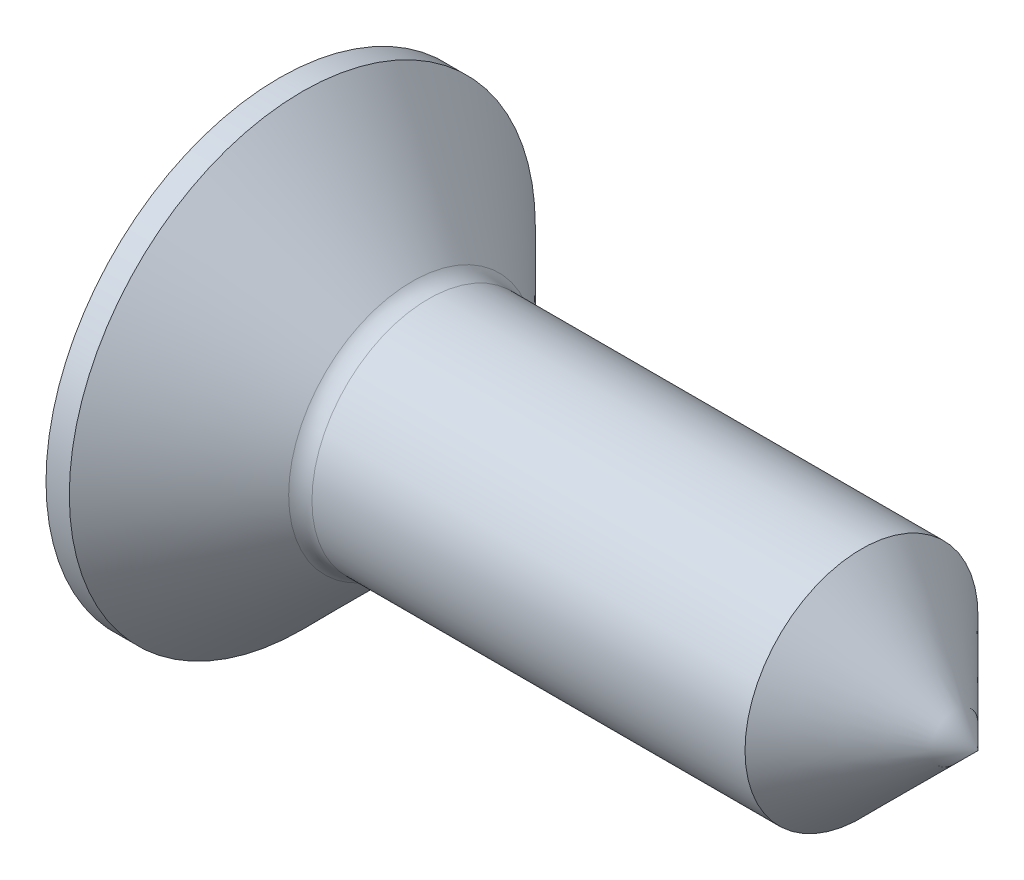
ISO-10303-21;
HEADER;
FILE_DESCRIPTION(('STEP AP214'),'2;1');
FILE_NAME('part.step','',(''),(''),'','','');
FILE_SCHEMA(('AUTOMOTIVE_DESIGN { 1 0 10303 214 1 1 1 1 }'));
ENDSEC;
DATA;
#1=APPLICATION_CONTEXT('core data for automotive mechanical design processes');
#2=APPLICATION_PROTOCOL_DEFINITION('international standard','automotive_design',2000,#1);
#3=PRODUCT_CONTEXT('',#1,'mechanical');
#4=PRODUCT('Part','Part','',(#3));
#5=PRODUCT_RELATED_PRODUCT_CATEGORY('part','',(#4));
#6=PRODUCT_DEFINITION_FORMATION('','',#4);
#7=PRODUCT_DEFINITION_CONTEXT('part definition',#1,'design');
#8=PRODUCT_DEFINITION('design','',#6,#7);
#9=PRODUCT_DEFINITION_SHAPE('','',#8);
#10=(LENGTH_UNIT() NAMED_UNIT(*) SI_UNIT(.MILLI.,.METRE.));
#11=(NAMED_UNIT(*) PLANE_ANGLE_UNIT() SI_UNIT($,.RADIAN.));
#12=(NAMED_UNIT(*) SI_UNIT($,.STERADIAN.) SOLID_ANGLE_UNIT());
#13=UNCERTAINTY_MEASURE_WITH_UNIT(LENGTH_MEASURE(1.E-05),#10,'distance_accuracy_value','');
#14=(GEOMETRIC_REPRESENTATION_CONTEXT(3) GLOBAL_UNCERTAINTY_ASSIGNED_CONTEXT((#13)) GLOBAL_UNIT_ASSIGNED_CONTEXT((#10,
#11,#12)) REPRESENTATION_CONTEXT('',''));
#15=CARTESIAN_POINT('',(0.,0.,0.));
#16=DIRECTION('',(0.,0.,1.));
#17=DIRECTION('',(1.,0.,0.));
#18=AXIS2_PLACEMENT_3D('',#15,#16,#17);
#19=CARTESIAN_POINT('',(3.63333333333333,0.,0.));
#20=DIRECTION('',(-1.,0.,0.));
#21=DIRECTION('',(0.,0.,-1.));
#22=AXIS2_PLACEMENT_3D('',#19,#20,#21);
#23=SPHERICAL_SURFACE('',#22,3.63333333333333);
#24=CARTESIAN_POINT('',(0.6,0.,0.));
#25=DIRECTION('',(-1.,0.,0.));
#26=DIRECTION('',(0.,0.,1.));
#27=AXIS2_PLACEMENT_3D('',#24,#25,#26);
#28=CIRCLE('',#27,2.);
#29=CARTESIAN_POINT('',(0.6,0.,2.));
#30=VERTEX_POINT('',#29);
#31=EDGE_CURVE('E216',#30,#30,#28,.T.);
#32=ORIENTED_EDGE('',*,*,#31,.T.);
#33=EDGE_LOOP('',(#32));
#34=FACE_BOUND('',#33,.T.);
#35=CARTESIAN_POINT('',(3.55368534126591,-0.389390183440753,0.));
#36=DIRECTION('',(-0.200396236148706,-0.979714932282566,0.));
#37=DIRECTION('',(0.979714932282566,-0.200396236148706,0.));
#38=AXIS2_PLACEMENT_3D('',#35,#36,#37);
#39=CIRCLE('',#38,3.61152912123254);
#40=CARTESIAN_POINT('',(0.209209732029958,0.294707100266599,1.1788284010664));
#41=VERTEX_POINT('',#40);
#42=CARTESIAN_POINT('',(0.0303348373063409,0.331295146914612,0.331295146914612));
#43=VERTEX_POINT('',#42);
#44=EDGE_CURVE('E12',#41,#43,#39,.T.);
#45=ORIENTED_EDGE('',*,*,#44,.F.);
#46=CARTESIAN_POINT('',(2.83803630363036,0.,-0.972029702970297));
#47=DIRECTION('',(-0.633237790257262,0.,-0.773957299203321));
#48=DIRECTION('',(-0.773957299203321,0.,0.633237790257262));
#49=AXIS2_PLACEMENT_3D('',#46,#47,#48);
#50=CIRCLE('',#49,3.40936533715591);
#51=CARTESIAN_POINT('',(0.209209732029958,-0.2947071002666,1.1788284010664));
#52=VERTEX_POINT('',#51);
#53=EDGE_CURVE('E120',#52,#41,#50,.T.);
#54=ORIENTED_EDGE('',*,*,#53,.F.);
#55=CARTESIAN_POINT('',(3.55368534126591,0.389390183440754,0.));
#56=DIRECTION('',(-0.200396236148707,0.979714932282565,0.));
#57=DIRECTION('',(-0.979714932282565,-0.200396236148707,0.));
#58=AXIS2_PLACEMENT_3D('',#55,#56,#57);
#59=CIRCLE('',#58,3.61152912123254);
#60=CARTESIAN_POINT('',(0.0303348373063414,-0.331295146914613,0.331295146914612));
#61=VERTEX_POINT('',#60);
#62=EDGE_CURVE('E128',#61,#52,#59,.T.);
#63=ORIENTED_EDGE('',*,*,#62,.F.);
#64=CARTESIAN_POINT('',(3.55368534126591,0.,-0.389390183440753));
#65=DIRECTION('',(-0.200396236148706,0.,-0.979714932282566));
#66=DIRECTION('',(-0.979714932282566,0.,0.200396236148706));
#67=AXIS2_PLACEMENT_3D('',#64,#65,#66);
#68=CIRCLE('',#67,3.61152912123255);
#69=CARTESIAN_POINT('',(0.209209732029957,-1.1788284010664,0.294707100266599));
#70=VERTEX_POINT('',#69);
#71=EDGE_CURVE('E136',#70,#61,#68,.T.);
#72=ORIENTED_EDGE('',*,*,#71,.F.);
#73=CARTESIAN_POINT('',(2.83803630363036,0.972029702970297,0.));
#74=DIRECTION('',(-0.633237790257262,0.773957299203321,0.));
#75=DIRECTION('',(-0.773957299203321,-0.633237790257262,0.));
#76=AXIS2_PLACEMENT_3D('',#73,#74,#75);
#77=CIRCLE('',#76,3.40936533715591);
#78=CARTESIAN_POINT('',(0.209209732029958,-1.1788284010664,-0.2947071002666));
#79=VERTEX_POINT('',#78);
#80=EDGE_CURVE('E144',#79,#70,#77,.T.);
#81=ORIENTED_EDGE('',*,*,#80,.F.);
#82=CARTESIAN_POINT('',(3.55368534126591,0.,0.389390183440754));
#83=DIRECTION('',(-0.200396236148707,0.,0.979714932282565));
#84=DIRECTION('',(0.979714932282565,0.,0.200396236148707));
#85=AXIS2_PLACEMENT_3D('',#82,#83,#84);
#86=CIRCLE('',#85,3.61152912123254);
#87=CARTESIAN_POINT('',(0.0303348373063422,-0.331295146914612,-0.331295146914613));
#88=VERTEX_POINT('',#87);
#89=EDGE_CURVE('E152',#88,#79,#86,.T.);
#90=ORIENTED_EDGE('',*,*,#89,.F.);
#91=CARTESIAN_POINT('',(3.55368534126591,0.389390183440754,0.));
#92=DIRECTION('',(-0.200396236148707,0.979714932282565,0.));
#93=DIRECTION('',(-0.979714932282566,-0.200396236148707,0.));
#94=AXIS2_PLACEMENT_3D('',#91,#92,#93);
#95=CIRCLE('',#94,3.61152912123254);
#96=CARTESIAN_POINT('',(0.209209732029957,-0.2947071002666,-1.1788284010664));
#97=VERTEX_POINT('',#96);
#98=EDGE_CURVE('E160',#97,#88,#95,.T.);
#99=ORIENTED_EDGE('',*,*,#98,.F.);
#100=CARTESIAN_POINT('',(2.83803630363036,0.,0.972029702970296));
#101=DIRECTION('',(-0.633237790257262,0.,0.773957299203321));
#102=DIRECTION('',(0.773957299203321,0.,0.633237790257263));
#103=AXIS2_PLACEMENT_3D('',#100,#101,#102);
#104=CIRCLE('',#103,3.40936533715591);
#105=CARTESIAN_POINT('',(0.209209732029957,0.294707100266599,-1.1788284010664));
#106=VERTEX_POINT('',#105);
#107=EDGE_CURVE('E168',#106,#97,#104,.T.);
#108=ORIENTED_EDGE('',*,*,#107,.F.);
#109=CARTESIAN_POINT('',(3.55368534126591,-0.389390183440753,0.));
#110=DIRECTION('',(-0.200396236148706,-0.979714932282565,0.));
#111=DIRECTION('',(0.979714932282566,-0.200396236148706,0.));
#112=AXIS2_PLACEMENT_3D('',#109,#110,#111);
#113=CIRCLE('',#112,3.61152912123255);
#114=CARTESIAN_POINT('',(0.0303348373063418,0.331295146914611,-0.331295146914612));
#115=VERTEX_POINT('',#114);
#116=EDGE_CURVE('E176',#115,#106,#113,.T.);
#117=ORIENTED_EDGE('',*,*,#116,.F.);
#118=CARTESIAN_POINT('',(3.55368534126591,0.,0.389390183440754));
#119=DIRECTION('',(-0.200396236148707,0.,0.979714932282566));
#120=DIRECTION('',(0.979714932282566,0.,0.200396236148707));
#121=AXIS2_PLACEMENT_3D('',#118,#119,#120);
#122=CIRCLE('',#121,3.61152912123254);
#123=CARTESIAN_POINT('',(0.209209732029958,1.1788284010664,-0.2947071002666));
#124=VERTEX_POINT('',#123);
#125=EDGE_CURVE('E183',#124,#115,#122,.T.);
#126=ORIENTED_EDGE('',*,*,#125,.F.);
#127=CARTESIAN_POINT('',(2.83803630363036,-0.972029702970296,0.));
#128=DIRECTION('',(-0.633237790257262,-0.773957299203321,0.));
#129=DIRECTION('',(0.773957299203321,-0.633237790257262,0.));
#130=AXIS2_PLACEMENT_3D('',#127,#128,#129);
#131=CIRCLE('',#130,3.40936533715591);
#132=CARTESIAN_POINT('',(0.209209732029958,1.1788284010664,0.2947071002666));
#133=VERTEX_POINT('',#132);
#134=EDGE_CURVE('E187',#133,#124,#131,.T.);
#135=ORIENTED_EDGE('',*,*,#134,.F.);
#136=CARTESIAN_POINT('',(3.55368534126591,0.,-0.389390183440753));
#137=DIRECTION('',(-0.200396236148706,0.,-0.979714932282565));
#138=DIRECTION('',(-0.979714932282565,0.,0.200396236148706));
#139=AXIS2_PLACEMENT_3D('',#136,#137,#138);
#140=CIRCLE('',#139,3.61152912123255);
#141=EDGE_CURVE('E57',#43,#133,#140,.T.);
#142=ORIENTED_EDGE('',*,*,#141,.F.);
#143=EDGE_LOOP('',(#45,#54,#63,#72,#81,#90,#99,#108,#117,#126,#135,#142));
#144=FACE_BOUND('',#143,.T.);
#145=ADVANCED_FACE('F49',(#34,#144),#23,.T.);
#146=CARTESIAN_POINT('',(-7.24054878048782,0.,0.));
#147=DIRECTION('',(-1.,0.,0.));
#148=DIRECTION('',(0.,0.,1.));
#149=AXIS2_PLACEMENT_3D('',#146,#147,#148);
#150=CYLINDRICAL_SURFACE('',#149,1.);
#151=CARTESIAN_POINT('',(1.88284271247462,0.,0.));
#152=DIRECTION('',(-1.,0.,0.));
#153=DIRECTION('',(0.,0.,1.));
#154=AXIS2_PLACEMENT_3D('',#151,#152,#153);
#155=CIRCLE('',#154,1.);
#156=CARTESIAN_POINT('',(1.88284271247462,0.,1.));
#157=VERTEX_POINT('',#156);
#158=EDGE_CURVE('E225',#157,#157,#155,.F.);
#159=ORIENTED_EDGE('',*,*,#158,.T.);
#160=EDGE_LOOP('',(#159));
#161=FACE_BOUND('',#160,.T.);
#162=CARTESIAN_POINT('',(5.6,0.,0.));
#163=DIRECTION('',(-1.,0.,0.));
#164=DIRECTION('',(0.,0.,1.));
#165=AXIS2_PLACEMENT_3D('',#162,#163,#164);
#166=CIRCLE('',#165,1.);
#167=CARTESIAN_POINT('',(5.6,0.,1.));
#168=VERTEX_POINT('',#167);
#169=EDGE_CURVE('E112',#168,#168,#166,.F.);
#170=ORIENTED_EDGE('',*,*,#169,.F.);
#171=EDGE_LOOP('',(#170));
#172=FACE_BOUND('',#171,.T.);
#173=ADVANCED_FACE('F243',(#161,#172),#150,.T.);
#174=CARTESIAN_POINT('',(1.8,0.,0.));
#175=DIRECTION('',(-1.,0.,0.));
#176=DIRECTION('',(0.,0.,1.));
#177=AXIS2_PLACEMENT_3D('',#174,#175,#176);
#178=CONICAL_SURFACE('',#177,1.,0.785398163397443);
#179=CARTESIAN_POINT('',(1.74142135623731,0.,0.));
#180=DIRECTION('',(-1.,0.,0.));
#181=DIRECTION('',(0.,0.,1.));
#182=AXIS2_PLACEMENT_3D('',#179,#180,#181);
#183=CIRCLE('',#182,1.05857864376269);
#184=CARTESIAN_POINT('',(1.74142135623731,0.,1.05857864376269));
#185=VERTEX_POINT('',#184);
#186=EDGE_CURVE('E222',#185,#185,#183,.T.);
#187=ORIENTED_EDGE('',*,*,#186,.T.);
#188=EDGE_LOOP('',(#187));
#189=FACE_BOUND('',#188,.T.);
#190=CARTESIAN_POINT('',(0.79999999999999,0.,0.));
#191=DIRECTION('',(-1.,0.,0.));
#192=DIRECTION('',(0.,0.,1.));
#193=AXIS2_PLACEMENT_3D('',#190,#191,#192);
#194=CIRCLE('',#193,2.);
#195=CARTESIAN_POINT('',(0.79999999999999,0.,2.));
#196=VERTEX_POINT('',#195);
#197=EDGE_CURVE('E219',#196,#196,#194,.T.);
#198=ORIENTED_EDGE('',*,*,#197,.F.);
#199=EDGE_LOOP('',(#198));
#200=FACE_BOUND('',#199,.T.);
#201=ADVANCED_FACE('F245',(#189,#200),#178,.T.);
#202=CARTESIAN_POINT('',(-7.24054878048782,0.,0.));
#203=DIRECTION('',(-1.,0.,0.));
#204=DIRECTION('',(0.,0.,1.));
#205=AXIS2_PLACEMENT_3D('',#202,#203,#204);
#206=CYLINDRICAL_SURFACE('',#205,2.);
#207=ORIENTED_EDGE('',*,*,#31,.F.);
#208=EDGE_LOOP('',(#207));
#209=FACE_BOUND('',#208,.T.);
#210=ORIENTED_EDGE('',*,*,#197,.T.);
#211=EDGE_LOOP('',(#210));
#212=FACE_BOUND('',#211,.T.);
#213=ADVANCED_FACE('F252',(#209,#212),#206,.T.);
#214=CARTESIAN_POINT('',(1.88284271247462,0.,0.));
#215=DIRECTION('',(-1.,0.,0.));
#216=DIRECTION('',(0.,0.,1.));
#217=AXIS2_PLACEMENT_3D('',#214,#215,#216);
#218=TOROIDAL_SURFACE('',#217,1.2,0.2);
#219=ORIENTED_EDGE('',*,*,#158,.F.);
#220=EDGE_LOOP('',(#219));
#221=FACE_BOUND('',#220,.T.);
#222=ORIENTED_EDGE('',*,*,#186,.F.);
#223=EDGE_LOOP('',(#222));
#224=FACE_BOUND('',#223,.T.);
#225=ADVANCED_FACE('F51',(#221,#224),#218,.F.);
#226=CARTESIAN_POINT('',(-13.3999999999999,0.,0.));
#227=DIRECTION('',(-1.,0.,0.));
#228=DIRECTION('',(0.,0.,1.));
#229=AXIS2_PLACEMENT_3D('',#226,#227,#228);
#230=CONICAL_SURFACE('',#229,20.,0.78539816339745);
#231=CARTESIAN_POINT('',(6.6,0.,0.));
#232=VERTEX_POINT('',#231);
#233=VERTEX_LOOP('',#232);
#234=FACE_BOUND('',#233,.T.);
#235=ORIENTED_EDGE('',*,*,#169,.T.);
#236=EDGE_LOOP('',(#235));
#237=FACE_BOUND('',#236,.T.);
#238=ADVANCED_FACE('F241',(#234,#237),#230,.T.);
#239=CARTESIAN_POINT('',(0.,0.337499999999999,1.35));
#240=DIRECTION('',(-0.200396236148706,-0.979714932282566,0.));
#241=DIRECTION('',(0.979714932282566,-0.200396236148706,0.));
#242=AXIS2_PLACEMENT_3D('',#239,#240,#241);
#243=PLANE('',#242);
#244=ORIENTED_EDGE('',*,*,#44,.T.);
#245=DIRECTION('',(0.96061626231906,-0.196489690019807,-0.196489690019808));
#246=VECTOR('',#245,1.);
#247=CARTESIAN_POINT('',(0.,0.3375,0.3375));
#248=LINE('',#247,#246);
#249=CARTESIAN_POINT('',(1.65,0.,0.));
#250=VERTEX_POINT('',#249);
#251=EDGE_CURVE('E105',#43,#250,#248,.T.);
#252=ORIENTED_EDGE('',*,*,#251,.T.);
#253=DIRECTION('',(0.764437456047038,-0.156362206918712,-0.625448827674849));
#254=VECTOR('',#253,1.);
#255=CARTESIAN_POINT('',(0.,0.337499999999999,1.35));
#256=LINE('',#255,#254);
#257=EDGE_CURVE('E108',#41,#250,#256,.T.);
#258=ORIENTED_EDGE('',*,*,#257,.F.);
#259=EDGE_LOOP('',(#244,#252,#258));
#260=FACE_BOUND('',#259,.T.);
#261=ADVANCED_FACE('F107',(#260),#243,.T.);
#262=CARTESIAN_POINT('',(0.,0.3375,0.3375));
#263=DIRECTION('',(-0.200396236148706,0.,-0.979714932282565));
#264=DIRECTION('',(-0.979714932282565,0.,0.200396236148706));
#265=AXIS2_PLACEMENT_3D('',#262,#263,#264);
#266=PLANE('',#265);
#267=ORIENTED_EDGE('',*,*,#141,.T.);
#268=DIRECTION('',(0.764437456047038,-0.625448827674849,-0.156362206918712));
#269=VECTOR('',#268,1.);
#270=CARTESIAN_POINT('',(0.,1.35,0.3375));
#271=LINE('',#270,#269);
#272=EDGE_CURVE('E64',#133,#250,#271,.T.);
#273=ORIENTED_EDGE('',*,*,#272,.T.);
#274=ORIENTED_EDGE('',*,*,#251,.F.);
#275=EDGE_LOOP('',(#267,#273,#274));
#276=FACE_BOUND('',#275,.T.);
#277=ADVANCED_FACE('F189',(#276),#266,.T.);
#278=CARTESIAN_POINT('',(0.,-0.3375,1.35));
#279=DIRECTION('',(-0.633237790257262,0.,-0.773957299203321));
#280=DIRECTION('',(-0.773957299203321,0.,0.633237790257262));
#281=AXIS2_PLACEMENT_3D('',#278,#279,#280);
#282=PLANE('',#281);
#283=ORIENTED_EDGE('',*,*,#53,.T.);
#284=ORIENTED_EDGE('',*,*,#257,.T.);
#285=DIRECTION('',(0.764437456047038,0.156362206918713,-0.625448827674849));
#286=VECTOR('',#285,1.);
#287=CARTESIAN_POINT('',(0.,-0.337500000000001,1.35));
#288=LINE('',#287,#286);
#289=EDGE_CURVE('E118',#52,#250,#288,.T.);
#290=ORIENTED_EDGE('',*,*,#289,.F.);
#291=EDGE_LOOP('',(#283,#284,#290));
#292=FACE_BOUND('',#291,.T.);
#293=ADVANCED_FACE('F117',(#292),#282,.T.);
#294=CARTESIAN_POINT('',(0.,-0.337500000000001,0.3375));
#295=DIRECTION('',(-0.200396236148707,0.979714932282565,0.));
#296=DIRECTION('',(-0.979714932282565,-0.200396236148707,0.));
#297=AXIS2_PLACEMENT_3D('',#294,#295,#296);
#298=PLANE('',#297);
#299=ORIENTED_EDGE('',*,*,#62,.T.);
#300=ORIENTED_EDGE('',*,*,#289,.T.);
#301=DIRECTION('',(0.960616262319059,0.196489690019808,-0.196489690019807));
#302=VECTOR('',#301,1.);
#303=CARTESIAN_POINT('',(0.,-0.337500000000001,0.3375));
#304=LINE('',#303,#302);
#305=EDGE_CURVE('E126',#61,#250,#304,.T.);
#306=ORIENTED_EDGE('',*,*,#305,.F.);
#307=EDGE_LOOP('',(#299,#300,#306));
#308=FACE_BOUND('',#307,.T.);
#309=ADVANCED_FACE('F125',(#308),#298,.T.);
#310=CARTESIAN_POINT('',(0.,-1.35,0.3375));
#311=DIRECTION('',(-0.200396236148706,0.,-0.979714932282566));
#312=DIRECTION('',(-0.979714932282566,0.,0.200396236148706));
#313=AXIS2_PLACEMENT_3D('',#310,#311,#312);
#314=PLANE('',#313);
#315=ORIENTED_EDGE('',*,*,#71,.T.);
#316=ORIENTED_EDGE('',*,*,#305,.T.);
#317=DIRECTION('',(0.764437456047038,0.625448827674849,-0.156362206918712));
#318=VECTOR('',#317,1.);
#319=CARTESIAN_POINT('',(0.,-1.35,0.3375));
#320=LINE('',#319,#318);
#321=EDGE_CURVE('E134',#70,#250,#320,.T.);
#322=ORIENTED_EDGE('',*,*,#321,.F.);
#323=EDGE_LOOP('',(#315,#316,#322));
#324=FACE_BOUND('',#323,.T.);
#325=ADVANCED_FACE('F133',(#324),#314,.T.);
#326=CARTESIAN_POINT('',(0.,-1.35,-0.337500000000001));
#327=DIRECTION('',(-0.633237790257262,0.773957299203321,0.));
#328=DIRECTION('',(-0.773957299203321,-0.633237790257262,0.));
#329=AXIS2_PLACEMENT_3D('',#326,#327,#328);
#330=PLANE('',#329);
#331=ORIENTED_EDGE('',*,*,#80,.T.);
#332=ORIENTED_EDGE('',*,*,#321,.T.);
#333=DIRECTION('',(0.764437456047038,0.625448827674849,0.156362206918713));
#334=VECTOR('',#333,1.);
#335=CARTESIAN_POINT('',(0.,-1.35,-0.337500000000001));
#336=LINE('',#335,#334);
#337=EDGE_CURVE('E142',#79,#250,#336,.T.);
#338=ORIENTED_EDGE('',*,*,#337,.F.);
#339=EDGE_LOOP('',(#331,#332,#338));
#340=FACE_BOUND('',#339,.T.);
#341=ADVANCED_FACE('F141',(#340),#330,.T.);
#342=CARTESIAN_POINT('',(0.,-0.337500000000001,-0.337500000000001));
#343=DIRECTION('',(-0.200396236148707,0.,0.979714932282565));
#344=DIRECTION('',(0.979714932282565,0.,0.200396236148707));
#345=AXIS2_PLACEMENT_3D('',#342,#343,#344);
#346=PLANE('',#345);
#347=ORIENTED_EDGE('',*,*,#89,.T.);
#348=ORIENTED_EDGE('',*,*,#337,.T.);
#349=DIRECTION('',(0.960616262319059,0.196489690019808,0.196489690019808));
#350=VECTOR('',#349,1.);
#351=CARTESIAN_POINT('',(0.,-0.337500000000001,-0.337500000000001));
#352=LINE('',#351,#350);
#353=EDGE_CURVE('E150',#88,#250,#352,.T.);
#354=ORIENTED_EDGE('',*,*,#353,.F.);
#355=EDGE_LOOP('',(#347,#348,#354));
#356=FACE_BOUND('',#355,.T.);
#357=ADVANCED_FACE('F149',(#356),#346,.T.);
#358=CARTESIAN_POINT('',(0.,-0.3375,-1.35));
#359=DIRECTION('',(-0.200396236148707,0.979714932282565,0.));
#360=DIRECTION('',(-0.979714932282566,-0.200396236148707,0.));
#361=AXIS2_PLACEMENT_3D('',#358,#359,#360);
#362=PLANE('',#361);
#363=ORIENTED_EDGE('',*,*,#98,.T.);
#364=ORIENTED_EDGE('',*,*,#353,.T.);
#365=DIRECTION('',(0.764437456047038,0.156362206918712,0.625448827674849));
#366=VECTOR('',#365,1.);
#367=CARTESIAN_POINT('',(0.,-0.3375,-1.35));
#368=LINE('',#367,#366);
#369=EDGE_CURVE('E158',#97,#250,#368,.T.);
#370=ORIENTED_EDGE('',*,*,#369,.F.);
#371=EDGE_LOOP('',(#363,#364,#370));
#372=FACE_BOUND('',#371,.T.);
#373=ADVANCED_FACE('F157',(#372),#362,.T.);
#374=CARTESIAN_POINT('',(0.,0.3375,-1.35));
#375=DIRECTION('',(-0.633237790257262,0.,0.773957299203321));
#376=DIRECTION('',(0.773957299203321,0.,0.633237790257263));
#377=AXIS2_PLACEMENT_3D('',#374,#375,#376);
#378=PLANE('',#377);
#379=ORIENTED_EDGE('',*,*,#107,.T.);
#380=ORIENTED_EDGE('',*,*,#369,.T.);
#381=DIRECTION('',(0.764437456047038,-0.156362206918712,0.625448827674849));
#382=VECTOR('',#381,1.);
#383=CARTESIAN_POINT('',(0.,0.3375,-1.35));
#384=LINE('',#383,#382);
#385=EDGE_CURVE('E166',#106,#250,#384,.T.);
#386=ORIENTED_EDGE('',*,*,#385,.F.);
#387=EDGE_LOOP('',(#379,#380,#386));
#388=FACE_BOUND('',#387,.T.);
#389=ADVANCED_FACE('F165',(#388),#378,.T.);
#390=CARTESIAN_POINT('',(0.,0.3375,-0.3375));
#391=DIRECTION('',(-0.200396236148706,-0.979714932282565,0.));
#392=DIRECTION('',(0.979714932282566,-0.200396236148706,0.));
#393=AXIS2_PLACEMENT_3D('',#390,#391,#392);
#394=PLANE('',#393);
#395=ORIENTED_EDGE('',*,*,#116,.T.);
#396=ORIENTED_EDGE('',*,*,#385,.T.);
#397=DIRECTION('',(0.960616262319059,-0.196489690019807,0.196489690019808));
#398=VECTOR('',#397,1.);
#399=CARTESIAN_POINT('',(0.,0.3375,-0.3375));
#400=LINE('',#399,#398);
#401=EDGE_CURVE('E174',#115,#250,#400,.T.);
#402=ORIENTED_EDGE('',*,*,#401,.F.);
#403=EDGE_LOOP('',(#395,#396,#402));
#404=FACE_BOUND('',#403,.T.);
#405=ADVANCED_FACE('F173',(#404),#394,.T.);
#406=CARTESIAN_POINT('',(0.,1.35,-0.3375));
#407=DIRECTION('',(-0.200396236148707,0.,0.979714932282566));
#408=DIRECTION('',(0.979714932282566,0.,0.200396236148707));
#409=AXIS2_PLACEMENT_3D('',#406,#407,#408);
#410=PLANE('',#409);
#411=ORIENTED_EDGE('',*,*,#125,.T.);
#412=ORIENTED_EDGE('',*,*,#401,.T.);
#413=DIRECTION('',(0.764437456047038,-0.625448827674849,0.156362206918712));
#414=VECTOR('',#413,1.);
#415=CARTESIAN_POINT('',(0.,1.35,-0.3375));
#416=LINE('',#415,#414);
#417=EDGE_CURVE('E181',#124,#250,#416,.T.);
#418=ORIENTED_EDGE('',*,*,#417,.F.);
#419=EDGE_LOOP('',(#411,#412,#418));
#420=FACE_BOUND('',#419,.T.);
#421=ADVANCED_FACE('F180',(#420),#410,.T.);
#422=CARTESIAN_POINT('',(0.,1.35,0.3375));
#423=DIRECTION('',(-0.633237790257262,-0.773957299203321,0.));
#424=DIRECTION('',(0.773957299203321,-0.633237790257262,0.));
#425=AXIS2_PLACEMENT_3D('',#422,#423,#424);
#426=PLANE('',#425);
#427=ORIENTED_EDGE('',*,*,#134,.T.);
#428=ORIENTED_EDGE('',*,*,#417,.T.);
#429=ORIENTED_EDGE('',*,*,#272,.F.);
#430=EDGE_LOOP('',(#427,#428,#429));
#431=FACE_BOUND('',#430,.T.);
#432=ADVANCED_FACE('F185',(#431),#426,.T.);
#433=CLOSED_SHELL('',(#145,#173,#201,#213,#225,#238,#261,#277,#293,#309,#325,#341,#357,#373,
#389,#405,#421,#432));
#434=MANIFOLD_SOLID_BREP('B2',#433);
#435=ADVANCED_BREP_SHAPE_REPRESENTATION('',(#18,#434),#14);
#436=SHAPE_DEFINITION_REPRESENTATION(#9,#435);
ENDSEC;
END-ISO-10303-21;
